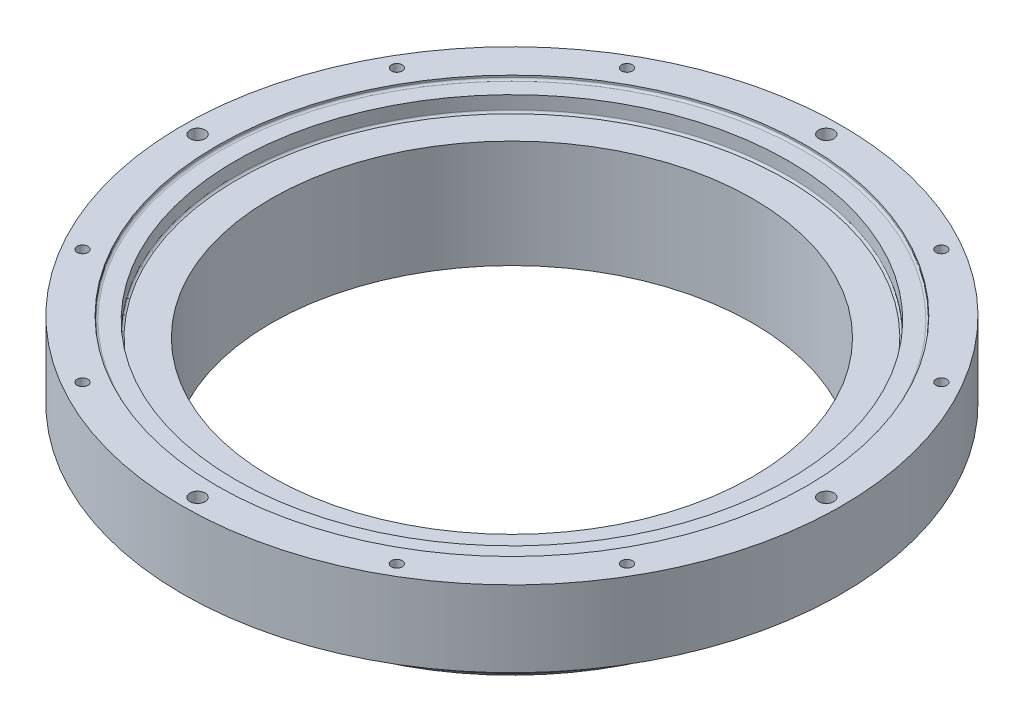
ISO-10303-21;
HEADER;
FILE_DESCRIPTION(('STEP AP214'),'2;1');
FILE_NAME('part.step','',(''),(''),'','','');
FILE_SCHEMA(('AUTOMOTIVE_DESIGN { 1 0 10303 214 1 1 1 1 }'));
ENDSEC;
DATA;
#1=APPLICATION_CONTEXT('core data for automotive mechanical design processes');
#2=APPLICATION_PROTOCOL_DEFINITION('international standard','automotive_design',2000,#1);
#3=PRODUCT_CONTEXT('',#1,'mechanical');
#4=PRODUCT('Part','Part','',(#3));
#5=PRODUCT_RELATED_PRODUCT_CATEGORY('part','',(#4));
#6=PRODUCT_DEFINITION_FORMATION('','',#4);
#7=PRODUCT_DEFINITION_CONTEXT('part definition',#1,'design');
#8=PRODUCT_DEFINITION('design','',#6,#7);
#9=PRODUCT_DEFINITION_SHAPE('','',#8);
#10=(LENGTH_UNIT() NAMED_UNIT(*) SI_UNIT(.MILLI.,.METRE.));
#11=(NAMED_UNIT(*) PLANE_ANGLE_UNIT() SI_UNIT($,.RADIAN.));
#12=(NAMED_UNIT(*) SI_UNIT($,.STERADIAN.) SOLID_ANGLE_UNIT());
#13=UNCERTAINTY_MEASURE_WITH_UNIT(LENGTH_MEASURE(1.E-05),#10,'distance_accuracy_value','');
#14=(GEOMETRIC_REPRESENTATION_CONTEXT(3) GLOBAL_UNCERTAINTY_ASSIGNED_CONTEXT((#13)) GLOBAL_UNIT_ASSIGNED_CONTEXT((#10,
#11,#12)) REPRESENTATION_CONTEXT('',''));
#15=CARTESIAN_POINT('',(0.,0.,0.));
#16=DIRECTION('',(0.,0.,1.));
#17=DIRECTION('',(1.,0.,0.));
#18=AXIS2_PLACEMENT_3D('',#15,#16,#17);
#19=CARTESIAN_POINT('',(-68.1908402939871,19.05,-39.3699999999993));
#20=DIRECTION('',(0.,1.,0.));
#21=DIRECTION('',(0.,0.,1.));
#22=AXIS2_PLACEMENT_3D('',#19,#20,#21);
#23=CYLINDRICAL_SURFACE('',#22,1.35254999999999);
#24=CARTESIAN_POINT('',(-68.1908402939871,19.05,-39.3699999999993));
#25=DIRECTION('',(0.,1.,0.));
#26=DIRECTION('',(0.,0.,1.));
#27=AXIS2_PLACEMENT_3D('',#24,#25,#26);
#28=CIRCLE('',#27,1.35254999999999);
#29=CARTESIAN_POINT('',(-68.1908402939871,19.05,-38.0174499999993));
#30=VERTEX_POINT('',#29);
#31=EDGE_CURVE('E195',#30,#30,#28,.T.);
#32=ORIENTED_EDGE('',*,*,#31,.T.);
#33=EDGE_LOOP('',(#32));
#34=FACE_BOUND('',#33,.T.);
#35=CARTESIAN_POINT('',(-68.1908402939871,12.7,-39.3699999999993));
#36=DIRECTION('',(0.,-1.,0.));
#37=DIRECTION('',(0.,0.,-1.));
#38=AXIS2_PLACEMENT_3D('',#35,#36,#37);
#39=CIRCLE('',#38,1.35254999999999);
#40=CARTESIAN_POINT('',(-68.1908402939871,12.7,-40.7225499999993));
#41=VERTEX_POINT('',#40);
#42=EDGE_CURVE('E92',#41,#41,#39,.F.);
#43=ORIENTED_EDGE('',*,*,#42,.F.);
#44=EDGE_LOOP('',(#43));
#45=FACE_BOUND('',#44,.T.);
#46=ADVANCED_FACE('F41',(#34,#45),#23,.F.);
#47=CARTESIAN_POINT('',(-39.3699999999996,19.05,68.190840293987));
#48=DIRECTION('',(0.,1.,0.));
#49=DIRECTION('',(0.,0.,1.));
#50=AXIS2_PLACEMENT_3D('',#47,#48,#49);
#51=CYLINDRICAL_SURFACE('',#50,1.35254999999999);
#52=CARTESIAN_POINT('',(-39.3699999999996,19.05,68.190840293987));
#53=DIRECTION('',(0.,1.,0.));
#54=DIRECTION('',(0.,0.,1.));
#55=AXIS2_PLACEMENT_3D('',#52,#53,#54);
#56=CIRCLE('',#55,1.35254999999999);
#57=CARTESIAN_POINT('',(-39.3699999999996,19.05,69.5433902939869));
#58=VERTEX_POINT('',#57);
#59=EDGE_CURVE('E198',#58,#58,#56,.T.);
#60=ORIENTED_EDGE('',*,*,#59,.T.);
#61=EDGE_LOOP('',(#60));
#62=FACE_BOUND('',#61,.T.);
#63=CARTESIAN_POINT('',(-39.3699999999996,12.7,68.190840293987));
#64=DIRECTION('',(0.,-1.,0.));
#65=DIRECTION('',(0.,0.,-1.));
#66=AXIS2_PLACEMENT_3D('',#63,#64,#65);
#67=CIRCLE('',#66,1.35254999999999);
#68=CARTESIAN_POINT('',(-39.3699999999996,12.7,66.838290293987));
#69=VERTEX_POINT('',#68);
#70=EDGE_CURVE('E96',#69,#69,#67,.F.);
#71=ORIENTED_EDGE('',*,*,#70,.F.);
#72=EDGE_LOOP('',(#71));
#73=FACE_BOUND('',#72,.T.);
#74=ADVANCED_FACE('F307',(#62,#73),#51,.F.);
#75=CARTESIAN_POINT('',(68.1908402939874,19.05,39.3699999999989));
#76=DIRECTION('',(0.,1.,0.));
#77=DIRECTION('',(0.,0.,1.));
#78=AXIS2_PLACEMENT_3D('',#75,#76,#77);
#79=CYLINDRICAL_SURFACE('',#78,1.35254999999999);
#80=CARTESIAN_POINT('',(68.1908402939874,19.05,39.3699999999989));
#81=DIRECTION('',(0.,1.,0.));
#82=DIRECTION('',(0.,0.,1.));
#83=AXIS2_PLACEMENT_3D('',#80,#81,#82);
#84=CIRCLE('',#83,1.35254999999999);
#85=CARTESIAN_POINT('',(68.1908402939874,19.05,40.7225499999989));
#86=VERTEX_POINT('',#85);
#87=EDGE_CURVE('E201',#86,#86,#84,.T.);
#88=ORIENTED_EDGE('',*,*,#87,.T.);
#89=EDGE_LOOP('',(#88));
#90=FACE_BOUND('',#89,.T.);
#91=CARTESIAN_POINT('',(68.1908402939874,12.7,39.3699999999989));
#92=DIRECTION('',(0.,-1.,0.));
#93=DIRECTION('',(0.,0.,-1.));
#94=AXIS2_PLACEMENT_3D('',#91,#92,#93);
#95=CIRCLE('',#94,1.35254999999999);
#96=CARTESIAN_POINT('',(68.1908402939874,12.7,38.0174499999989));
#97=VERTEX_POINT('',#96);
#98=EDGE_CURVE('E99',#97,#97,#95,.F.);
#99=ORIENTED_EDGE('',*,*,#98,.F.);
#100=EDGE_LOOP('',(#99));
#101=FACE_BOUND('',#100,.T.);
#102=ADVANCED_FACE('F313',(#90,#101),#79,.F.);
#103=CARTESIAN_POINT('',(-39.3700000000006,19.05,-68.1908402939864));
#104=DIRECTION('',(0.,1.,0.));
#105=DIRECTION('',(0.,0.,1.));
#106=AXIS2_PLACEMENT_3D('',#103,#104,#105);
#107=CYLINDRICAL_SURFACE('',#106,1.35254999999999);
#108=CARTESIAN_POINT('',(-39.3700000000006,19.05,-68.1908402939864));
#109=DIRECTION('',(0.,1.,0.));
#110=DIRECTION('',(0.,0.,1.));
#111=AXIS2_PLACEMENT_3D('',#108,#109,#110);
#112=CIRCLE('',#111,1.35254999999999);
#113=CARTESIAN_POINT('',(-39.3700000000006,19.05,-66.8382902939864));
#114=VERTEX_POINT('',#113);
#115=EDGE_CURVE('E204',#114,#114,#112,.T.);
#116=ORIENTED_EDGE('',*,*,#115,.T.);
#117=EDGE_LOOP('',(#116));
#118=FACE_BOUND('',#117,.T.);
#119=CARTESIAN_POINT('',(-39.3700000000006,12.7,-68.1908402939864));
#120=DIRECTION('',(0.,-1.,0.));
#121=DIRECTION('',(0.,0.,-1.));
#122=AXIS2_PLACEMENT_3D('',#119,#120,#121);
#123=CIRCLE('',#122,1.35254999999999);
#124=CARTESIAN_POINT('',(-39.3700000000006,12.7,-69.5433902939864));
#125=VERTEX_POINT('',#124);
#126=EDGE_CURVE('E102',#125,#125,#123,.F.);
#127=ORIENTED_EDGE('',*,*,#126,.F.);
#128=EDGE_LOOP('',(#127));
#129=FACE_BOUND('',#128,.T.);
#130=ADVANCED_FACE('F773',(#118,#129),#107,.F.);
#131=CARTESIAN_POINT('',(-68.1908402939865,19.05,39.3700000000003));
#132=DIRECTION('',(0.,1.,0.));
#133=DIRECTION('',(0.,0.,1.));
#134=AXIS2_PLACEMENT_3D('',#131,#132,#133);
#135=CYLINDRICAL_SURFACE('',#134,1.35254999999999);
#136=CARTESIAN_POINT('',(-68.1908402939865,19.05,39.3700000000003));
#137=DIRECTION('',(0.,1.,0.));
#138=DIRECTION('',(0.,0.,1.));
#139=AXIS2_PLACEMENT_3D('',#136,#137,#138);
#140=CIRCLE('',#139,1.35254999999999);
#141=CARTESIAN_POINT('',(-68.1908402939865,19.05,40.7225500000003));
#142=VERTEX_POINT('',#141);
#143=EDGE_CURVE('E207',#142,#142,#140,.T.);
#144=ORIENTED_EDGE('',*,*,#143,.T.);
#145=EDGE_LOOP('',(#144));
#146=FACE_BOUND('',#145,.T.);
#147=CARTESIAN_POINT('',(-68.1908402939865,12.7,39.3700000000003));
#148=DIRECTION('',(0.,-1.,0.));
#149=DIRECTION('',(0.,0.,-1.));
#150=AXIS2_PLACEMENT_3D('',#147,#148,#149);
#151=CIRCLE('',#150,1.35254999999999);
#152=CARTESIAN_POINT('',(-68.1908402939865,12.7,38.0174500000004));
#153=VERTEX_POINT('',#152);
#154=EDGE_CURVE('E105',#153,#153,#151,.F.);
#155=ORIENTED_EDGE('',*,*,#154,.F.);
#156=EDGE_LOOP('',(#155));
#157=FACE_BOUND('',#156,.T.);
#158=ADVANCED_FACE('F763',(#146,#157),#135,.F.);
#159=CARTESIAN_POINT('',(39.3700000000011,19.05,68.1908402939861));
#160=DIRECTION('',(0.,1.,0.));
#161=DIRECTION('',(0.,0.,1.));
#162=AXIS2_PLACEMENT_3D('',#159,#160,#161);
#163=CYLINDRICAL_SURFACE('',#162,1.35254999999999);
#164=CARTESIAN_POINT('',(39.3700000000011,19.05,68.1908402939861));
#165=DIRECTION('',(0.,1.,0.));
#166=DIRECTION('',(0.,0.,1.));
#167=AXIS2_PLACEMENT_3D('',#164,#165,#166);
#168=CIRCLE('',#167,1.35254999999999);
#169=CARTESIAN_POINT('',(39.3700000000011,19.05,69.5433902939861));
#170=VERTEX_POINT('',#169);
#171=EDGE_CURVE('E95',#170,#170,#168,.T.);
#172=ORIENTED_EDGE('',*,*,#171,.T.);
#173=EDGE_LOOP('',(#172));
#174=FACE_BOUND('',#173,.T.);
#175=CARTESIAN_POINT('',(39.3700000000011,12.7,68.1908402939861));
#176=DIRECTION('',(0.,-1.,0.));
#177=DIRECTION('',(0.,0.,-1.));
#178=AXIS2_PLACEMENT_3D('',#175,#176,#177);
#179=CIRCLE('',#178,1.35254999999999);
#180=CARTESIAN_POINT('',(39.3700000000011,12.7,66.8382902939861));
#181=VERTEX_POINT('',#180);
#182=EDGE_CURVE('E108',#181,#181,#179,.F.);
#183=ORIENTED_EDGE('',*,*,#182,.F.);
#184=EDGE_LOOP('',(#183));
#185=FACE_BOUND('',#184,.T.);
#186=ADVANCED_FACE('F356',(#174,#185),#163,.F.);
#187=CARTESIAN_POINT('',(39.3699999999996,19.05,-68.190840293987));
#188=DIRECTION('',(0.,1.,0.));
#189=DIRECTION('',(0.,0.,1.));
#190=AXIS2_PLACEMENT_3D('',#187,#188,#189);
#191=CYLINDRICAL_SURFACE('',#190,1.35254999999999);
#192=CARTESIAN_POINT('',(39.3699999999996,19.05,-68.190840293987));
#193=DIRECTION('',(0.,1.,0.));
#194=DIRECTION('',(0.,0.,1.));
#195=AXIS2_PLACEMENT_3D('',#192,#193,#194);
#196=CIRCLE('',#195,1.35254999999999);
#197=CARTESIAN_POINT('',(39.3699999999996,19.05,-66.838290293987));
#198=VERTEX_POINT('',#197);
#199=EDGE_CURVE('E174',#198,#198,#196,.T.);
#200=ORIENTED_EDGE('',*,*,#199,.T.);
#201=EDGE_LOOP('',(#200));
#202=FACE_BOUND('',#201,.T.);
#203=CARTESIAN_POINT('',(39.3699999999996,12.7,-68.190840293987));
#204=DIRECTION('',(0.,-1.,0.));
#205=DIRECTION('',(0.,0.,-1.));
#206=AXIS2_PLACEMENT_3D('',#203,#204,#205);
#207=CIRCLE('',#206,1.35254999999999);
#208=CARTESIAN_POINT('',(39.3699999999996,12.7,-69.5433902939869));
#209=VERTEX_POINT('',#208);
#210=EDGE_CURVE('E125',#209,#209,#207,.F.);
#211=ORIENTED_EDGE('',*,*,#210,.F.);
#212=EDGE_LOOP('',(#211));
#213=FACE_BOUND('',#212,.T.);
#214=ADVANCED_FACE('F352',(#202,#213),#191,.F.);
#215=CARTESIAN_POINT('',(68.1908402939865,19.05,-39.3700000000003));
#216=DIRECTION('',(0.,1.,0.));
#217=DIRECTION('',(0.,0.,1.));
#218=AXIS2_PLACEMENT_3D('',#215,#216,#217);
#219=CYLINDRICAL_SURFACE('',#218,1.35254999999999);
#220=CARTESIAN_POINT('',(68.1908402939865,19.05,-39.3700000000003));
#221=DIRECTION('',(0.,1.,0.));
#222=DIRECTION('',(0.,0.,1.));
#223=AXIS2_PLACEMENT_3D('',#220,#221,#222);
#224=CIRCLE('',#223,1.35254999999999);
#225=CARTESIAN_POINT('',(68.1908402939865,19.05,-38.0174500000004));
#226=VERTEX_POINT('',#225);
#227=EDGE_CURVE('E128',#226,#226,#224,.T.);
#228=ORIENTED_EDGE('',*,*,#227,.T.);
#229=EDGE_LOOP('',(#228));
#230=FACE_BOUND('',#229,.T.);
#231=CARTESIAN_POINT('',(68.1908402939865,12.7,-39.3700000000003));
#232=DIRECTION('',(0.,-1.,0.));
#233=DIRECTION('',(0.,0.,-1.));
#234=AXIS2_PLACEMENT_3D('',#231,#232,#233);
#235=CIRCLE('',#234,1.35254999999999);
#236=CARTESIAN_POINT('',(68.1908402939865,12.7,-40.7225500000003));
#237=VERTEX_POINT('',#236);
#238=EDGE_CURVE('E129',#237,#237,#235,.F.);
#239=ORIENTED_EDGE('',*,*,#238,.F.);
#240=EDGE_LOOP('',(#239));
#241=FACE_BOUND('',#240,.T.);
#242=ADVANCED_FACE('F348',(#230,#241),#219,.F.);
#243=CARTESIAN_POINT('',(-66.6369,-12.7,0.));
#244=DIRECTION('',(0.,-1.,0.));
#245=DIRECTION('',(0.,0.,-1.));
#246=AXIS2_PLACEMENT_3D('',#243,#244,#245);
#247=PLANE('',#246);
#248=CARTESIAN_POINT('',(0.,-12.7,0.));
#249=DIRECTION('',(0.,-1.,0.));
#250=DIRECTION('',(0.,0.,-1.));
#251=AXIS2_PLACEMENT_3D('',#248,#249,#250);
#252=CIRCLE('',#251,65.3669);
#253=CARTESIAN_POINT('',(0.,-12.7,-65.3669));
#254=VERTEX_POINT('',#253);
#255=EDGE_CURVE('E91',#254,#254,#252,.T.);
#256=ORIENTED_EDGE('',*,*,#255,.T.);
#257=EDGE_LOOP('',(#256));
#258=FACE_BOUND('',#257,.T.);
#259=CARTESIAN_POINT('',(0.,-12.7,0.));
#260=DIRECTION('',(0.,1.,0.));
#261=DIRECTION('',(0.,0.,1.));
#262=AXIS2_PLACEMENT_3D('',#259,#260,#261);
#263=CIRCLE('',#262,60.325);
#264=CARTESIAN_POINT('',(0.,-12.7,60.325));
#265=VERTEX_POINT('',#264);
#266=EDGE_CURVE('E143',#265,#265,#263,.T.);
#267=ORIENTED_EDGE('',*,*,#266,.T.);
#268=EDGE_LOOP('',(#267));
#269=FACE_BOUND('',#268,.T.);
#270=ADVANCED_FACE('F351',(#258,#269),#247,.T.);
#271=CARTESIAN_POINT('',(0.,26.1974518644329,0.));
#272=DIRECTION('',(0.,1.,0.));
#273=DIRECTION('',(0.,0.,1.));
#274=AXIS2_PLACEMENT_3D('',#271,#272,#273);
#275=CYLINDRICAL_SURFACE('',#274,60.325);
#276=CARTESIAN_POINT('',(0.,14.300581,0.));
#277=DIRECTION('',(0.,1.,0.));
#278=DIRECTION('',(0.,0.,1.));
#279=AXIS2_PLACEMENT_3D('',#276,#277,#278);
#280=CIRCLE('',#279,60.325);
#281=CARTESIAN_POINT('',(0.,14.300581,60.325));
#282=VERTEX_POINT('',#281);
#283=EDGE_CURVE('E146',#282,#282,#280,.T.);
#284=ORIENTED_EDGE('',*,*,#283,.T.);
#285=EDGE_LOOP('',(#284));
#286=FACE_BOUND('',#285,.T.);
#287=ORIENTED_EDGE('',*,*,#266,.F.);
#288=EDGE_LOOP('',(#287));
#289=FACE_BOUND('',#288,.T.);
#290=ADVANCED_FACE('F445',(#286,#289),#275,.F.);
#291=CARTESIAN_POINT('',(-60.325,14.300581,0.));
#292=DIRECTION('',(0.,1.,0.));
#293=DIRECTION('',(0.,0.,1.));
#294=AXIS2_PLACEMENT_3D('',#291,#292,#293);
#295=PLANE('',#294);
#296=CARTESIAN_POINT('',(0.,14.300581,0.));
#297=DIRECTION('',(0.,1.,0.));
#298=DIRECTION('',(0.,0.,1.));
#299=AXIS2_PLACEMENT_3D('',#296,#297,#298);
#300=CIRCLE('',#299,68.707);
#301=CARTESIAN_POINT('',(0.,14.300581,68.707));
#302=VERTEX_POINT('',#301);
#303=EDGE_CURVE('E48',#302,#302,#300,.T.);
#304=ORIENTED_EDGE('',*,*,#303,.T.);
#305=EDGE_LOOP('',(#304));
#306=FACE_BOUND('',#305,.T.);
#307=ORIENTED_EDGE('',*,*,#283,.F.);
#308=EDGE_LOOP('',(#307));
#309=FACE_BOUND('',#308,.T.);
#310=ADVANCED_FACE('F440',(#306,#309),#295,.T.);
#311=CARTESIAN_POINT('',(0.,26.1974518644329,0.));
#312=DIRECTION('',(0.,1.,0.));
#313=DIRECTION('',(0.,0.,1.));
#314=AXIS2_PLACEMENT_3D('',#311,#312,#313);
#315=CYLINDRICAL_SURFACE('',#314,69.215);
#316=CARTESIAN_POINT('',(0.,14.808581,0.));
#317=DIRECTION('',(0.,1.,0.));
#318=DIRECTION('',(0.,0.,1.));
#319=AXIS2_PLACEMENT_3D('',#316,#317,#318);
#320=CIRCLE('',#319,69.215);
#321=CARTESIAN_POINT('',(0.,14.808581,69.215));
#322=VERTEX_POINT('',#321);
#323=EDGE_CURVE('E10',#322,#322,#320,.F.);
#324=ORIENTED_EDGE('',*,*,#323,.T.);
#325=EDGE_LOOP('',(#324));
#326=FACE_BOUND('',#325,.T.);
#327=CARTESIAN_POINT('',(0.,18.0848,0.));
#328=DIRECTION('',(0.,1.,0.));
#329=DIRECTION('',(0.,0.,1.));
#330=AXIS2_PLACEMENT_3D('',#327,#328,#329);
#331=CIRCLE('',#330,69.215);
#332=CARTESIAN_POINT('',(0.,18.0848,69.215));
#333=VERTEX_POINT('',#332);
#334=EDGE_CURVE('E149',#333,#333,#331,.T.);
#335=ORIENTED_EDGE('',*,*,#334,.T.);
#336=EDGE_LOOP('',(#335));
#337=FACE_BOUND('',#336,.T.);
#338=ADVANCED_FACE('F303',(#326,#337),#315,.F.);
#339=CARTESIAN_POINT('',(-69.215,18.0848,0.));
#340=DIRECTION('',(0.,1.,0.));
#341=DIRECTION('',(0.,0.,1.));
#342=AXIS2_PLACEMENT_3D('',#339,#340,#341);
#343=PLANE('',#342);
#344=CARTESIAN_POINT('',(0.,18.0848,0.));
#345=DIRECTION('',(0.,1.,0.));
#346=DIRECTION('',(0.,0.,1.));
#347=AXIS2_PLACEMENT_3D('',#344,#345,#346);
#348=CIRCLE('',#347,73.3298);
#349=CARTESIAN_POINT('',(0.,18.0848,73.3298));
#350=VERTEX_POINT('',#349);
#351=EDGE_CURVE('E56',#350,#350,#348,.T.);
#352=ORIENTED_EDGE('',*,*,#351,.T.);
#353=EDGE_LOOP('',(#352));
#354=FACE_BOUND('',#353,.T.);
#355=ORIENTED_EDGE('',*,*,#334,.F.);
#356=EDGE_LOOP('',(#355));
#357=FACE_BOUND('',#356,.T.);
#358=ADVANCED_FACE('F297',(#354,#357),#343,.T.);
#359=CARTESIAN_POINT('',(0.,26.1974518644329,0.));
#360=DIRECTION('',(0.,1.,0.));
#361=DIRECTION('',(0.,0.,1.));
#362=AXIS2_PLACEMENT_3D('',#359,#360,#361);
#363=CYLINDRICAL_SURFACE('',#362,73.8378);
#364=CARTESIAN_POINT('',(0.,18.5928,0.));
#365=DIRECTION('',(0.,1.,0.));
#366=DIRECTION('',(0.,0.,1.));
#367=AXIS2_PLACEMENT_3D('',#364,#365,#366);
#368=CIRCLE('',#367,73.8378);
#369=CARTESIAN_POINT('',(0.,18.5928,73.8378));
#370=VERTEX_POINT('',#369);
#371=EDGE_CURVE('E52',#370,#370,#368,.F.);
#372=ORIENTED_EDGE('',*,*,#371,.T.);
#373=EDGE_LOOP('',(#372));
#374=FACE_BOUND('',#373,.T.);
#375=CARTESIAN_POINT('',(0.,19.05,0.));
#376=DIRECTION('',(0.,1.,0.));
#377=DIRECTION('',(0.,0.,1.));
#378=AXIS2_PLACEMENT_3D('',#375,#376,#377);
#379=CIRCLE('',#378,73.8378);
#380=CARTESIAN_POINT('',(0.,19.05,73.8378));
#381=VERTEX_POINT('',#380);
#382=EDGE_CURVE('E152',#381,#381,#379,.T.);
#383=ORIENTED_EDGE('',*,*,#382,.T.);
#384=EDGE_LOOP('',(#383));
#385=FACE_BOUND('',#384,.T.);
#386=ADVANCED_FACE('F291',(#374,#385),#363,.F.);
#387=CARTESIAN_POINT('',(-73.8378,19.05,0.));
#388=DIRECTION('',(0.,1.,0.));
#389=DIRECTION('',(0.,0.,1.));
#390=AXIS2_PLACEMENT_3D('',#387,#388,#389);
#391=PLANE('',#390);
#392=ORIENTED_EDGE('',*,*,#171,.F.);
#393=EDGE_LOOP('',(#392));
#394=FACE_BOUND('',#393,.T.);
#395=ORIENTED_EDGE('',*,*,#143,.F.);
#396=EDGE_LOOP('',(#395));
#397=FACE_BOUND('',#396,.T.);
#398=ORIENTED_EDGE('',*,*,#115,.F.);
#399=EDGE_LOOP('',(#398));
#400=FACE_BOUND('',#399,.T.);
#401=ORIENTED_EDGE('',*,*,#87,.F.);
#402=EDGE_LOOP('',(#401));
#403=FACE_BOUND('',#402,.T.);
#404=ORIENTED_EDGE('',*,*,#59,.F.);
#405=EDGE_LOOP('',(#404));
#406=FACE_BOUND('',#405,.T.);
#407=ORIENTED_EDGE('',*,*,#31,.F.);
#408=EDGE_LOOP('',(#407));
#409=FACE_BOUND('',#408,.T.);
#410=CARTESIAN_POINT('',(78.74,19.05,-8.24757721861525E-13));
#411=DIRECTION('',(0.,1.,0.));
#412=DIRECTION('',(0.,0.,1.));
#413=AXIS2_PLACEMENT_3D('',#410,#411,#412);
#414=CIRCLE('',#413,1.89864999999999);
#415=CARTESIAN_POINT('',(78.74,19.05,1.89864999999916));
#416=VERTEX_POINT('',#415);
#417=EDGE_CURVE('E116',#416,#416,#414,.T.);
#418=ORIENTED_EDGE('',*,*,#417,.F.);
#419=EDGE_LOOP('',(#418));
#420=FACE_BOUND('',#419,.T.);
#421=CARTESIAN_POINT('',(0.,19.05,78.74));
#422=DIRECTION('',(0.,1.,0.));
#423=DIRECTION('',(0.,0.,1.));
#424=AXIS2_PLACEMENT_3D('',#421,#422,#423);
#425=CIRCLE('',#424,1.89864999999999);
#426=CARTESIAN_POINT('',(0.,19.05,80.63865));
#427=VERTEX_POINT('',#426);
#428=EDGE_CURVE('E115',#427,#427,#425,.T.);
#429=ORIENTED_EDGE('',*,*,#428,.F.);
#430=EDGE_LOOP('',(#429));
#431=FACE_BOUND('',#430,.T.);
#432=CARTESIAN_POINT('',(-78.74,19.05,2.74919240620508E-13));
#433=DIRECTION('',(0.,1.,0.));
#434=DIRECTION('',(0.,0.,1.));
#435=AXIS2_PLACEMENT_3D('',#432,#433,#434);
#436=CIRCLE('',#435,1.89864999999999);
#437=CARTESIAN_POINT('',(-78.74,19.05,1.89865000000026));
#438=VERTEX_POINT('',#437);
#439=EDGE_CURVE('E120',#438,#438,#436,.T.);
#440=ORIENTED_EDGE('',*,*,#439,.F.);
#441=EDGE_LOOP('',(#440));
#442=FACE_BOUND('',#441,.T.);
#443=ORIENTED_EDGE('',*,*,#227,.F.);
#444=EDGE_LOOP('',(#443));
#445=FACE_BOUND('',#444,.T.);
#446=ORIENTED_EDGE('',*,*,#199,.F.);
#447=EDGE_LOOP('',(#446));
#448=FACE_BOUND('',#447,.T.);
#449=CARTESIAN_POINT('',(0.,19.05,-78.74));
#450=DIRECTION('',(0.,1.,0.));
#451=DIRECTION('',(0.,0.,1.));
#452=AXIS2_PLACEMENT_3D('',#449,#450,#451);
#453=CIRCLE('',#452,1.89864999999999);
#454=CARTESIAN_POINT('',(0.,19.05,-76.84135));
#455=VERTEX_POINT('',#454);
#456=EDGE_CURVE('E137',#455,#455,#453,.T.);
#457=ORIENTED_EDGE('',*,*,#456,.F.);
#458=EDGE_LOOP('',(#457));
#459=FACE_BOUND('',#458,.T.);
#460=CARTESIAN_POINT('',(0.,19.05,0.));
#461=DIRECTION('',(0.,1.,0.));
#462=DIRECTION('',(0.,0.,1.));
#463=AXIS2_PLACEMENT_3D('',#460,#461,#462);
#464=CIRCLE('',#463,82.55);
#465=CARTESIAN_POINT('',(0.,19.05,82.55));
#466=VERTEX_POINT('',#465);
#467=EDGE_CURVE('E155',#466,#466,#464,.T.);
#468=ORIENTED_EDGE('',*,*,#467,.T.);
#469=EDGE_LOOP('',(#468));
#470=FACE_BOUND('',#469,.T.);
#471=ORIENTED_EDGE('',*,*,#382,.F.);
#472=EDGE_LOOP('',(#471));
#473=FACE_BOUND('',#472,.T.);
#474=ADVANCED_FACE('F285',(#394,#397,#400,#403,#406,#409,#420,#431,#442,#445,#448,#459,#470,
#473),#391,.T.);
#475=CARTESIAN_POINT('',(0.,26.1974518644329,0.));
#476=DIRECTION('',(0.,1.,0.));
#477=DIRECTION('',(0.,0.,1.));
#478=AXIS2_PLACEMENT_3D('',#475,#476,#477);
#479=CYLINDRICAL_SURFACE('',#478,82.55);
#480=CARTESIAN_POINT('',(0.,0.,0.));
#481=DIRECTION('',(0.,1.,0.));
#482=DIRECTION('',(0.,0.,1.));
#483=AXIS2_PLACEMENT_3D('',#480,#481,#482);
#484=CIRCLE('',#483,82.55);
#485=CARTESIAN_POINT('',(0.,0.,82.55));
#486=VERTEX_POINT('',#485);
#487=EDGE_CURVE('E158',#486,#486,#484,.T.);
#488=ORIENTED_EDGE('',*,*,#487,.T.);
#489=EDGE_LOOP('',(#488));
#490=FACE_BOUND('',#489,.T.);
#491=ORIENTED_EDGE('',*,*,#467,.F.);
#492=EDGE_LOOP('',(#491));
#493=FACE_BOUND('',#492,.T.);
#494=ADVANCED_FACE('F262',(#490,#493),#479,.T.);
#495=CARTESIAN_POINT('',(-82.55,0.,0.));
#496=DIRECTION('',(0.,-1.,0.));
#497=DIRECTION('',(0.,0.,-1.));
#498=AXIS2_PLACEMENT_3D('',#495,#496,#497);
#499=PLANE('',#498);
#500=CARTESIAN_POINT('',(68.1908402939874,0.,39.3699999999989));
#501=DIRECTION('',(0.,-1.,0.));
#502=DIRECTION('',(1.,0.,0.));
#503=AXIS2_PLACEMENT_3D('',#500,#501,#502);
#504=CIRCLE('',#503,1.905);
#505=CARTESIAN_POINT('',(70.0958402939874,0.,39.3699999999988));
#506=VERTEX_POINT('',#505);
#507=EDGE_CURVE('E230',#506,#506,#504,.T.);
#508=ORIENTED_EDGE('',*,*,#507,.F.);
#509=EDGE_LOOP('',(#508));
#510=FACE_BOUND('',#509,.T.);
#511=CARTESIAN_POINT('',(-68.1908402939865,0.,39.3700000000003));
#512=DIRECTION('',(0.,-1.,0.));
#513=DIRECTION('',(0.,0.,1.));
#514=AXIS2_PLACEMENT_3D('',#511,#512,#513);
#515=CIRCLE('',#514,1.90500000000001);
#516=CARTESIAN_POINT('',(-68.1908402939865,0.,41.2750000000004));
#517=VERTEX_POINT('',#516);
#518=EDGE_CURVE('E237',#517,#517,#515,.T.);
#519=ORIENTED_EDGE('',*,*,#518,.F.);
#520=EDGE_LOOP('',(#519));
#521=FACE_BOUND('',#520,.T.);
#522=CARTESIAN_POINT('',(-39.3699999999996,0.,68.190840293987));
#523=DIRECTION('',(0.,-1.,0.));
#524=DIRECTION('',(0.,0.,1.));
#525=AXIS2_PLACEMENT_3D('',#522,#523,#524);
#526=CIRCLE('',#525,1.905);
#527=CARTESIAN_POINT('',(-39.3699999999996,0.,70.095840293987));
#528=VERTEX_POINT('',#527);
#529=EDGE_CURVE('E218',#528,#528,#526,.T.);
#530=ORIENTED_EDGE('',*,*,#529,.F.);
#531=EDGE_LOOP('',(#530));
#532=FACE_BOUND('',#531,.T.);
#533=CARTESIAN_POINT('',(-39.3700000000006,0.,-68.1908402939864));
#534=DIRECTION('',(0.,-1.,0.));
#535=DIRECTION('',(-1.,0.,0.));
#536=AXIS2_PLACEMENT_3D('',#533,#534,#535);
#537=CIRCLE('',#536,1.90500000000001);
#538=CARTESIAN_POINT('',(-41.2750000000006,0.,-68.1908402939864));
#539=VERTEX_POINT('',#538);
#540=EDGE_CURVE('E225',#539,#539,#537,.T.);
#541=ORIENTED_EDGE('',*,*,#540,.F.);
#542=EDGE_LOOP('',(#541));
#543=FACE_BOUND('',#542,.T.);
#544=CARTESIAN_POINT('',(39.3700000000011,0.,68.1908402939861));
#545=DIRECTION('',(0.,-1.,0.));
#546=DIRECTION('',(1.,0.,0.));
#547=AXIS2_PLACEMENT_3D('',#544,#545,#546);
#548=CIRCLE('',#547,1.90500000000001);
#549=CARTESIAN_POINT('',(41.2750000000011,0.,68.1908402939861));
#550=VERTEX_POINT('',#549);
#551=EDGE_CURVE('E242',#550,#550,#548,.T.);
#552=ORIENTED_EDGE('',*,*,#551,.F.);
#553=EDGE_LOOP('',(#552));
#554=FACE_BOUND('',#553,.T.);
#555=CARTESIAN_POINT('',(-68.1908402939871,0.,-39.3699999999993));
#556=DIRECTION('',(0.,-1.,0.));
#557=DIRECTION('',(-1.,0.,0.));
#558=AXIS2_PLACEMENT_3D('',#555,#556,#557);
#559=CIRCLE('',#558,1.905);
#560=CARTESIAN_POINT('',(-70.0958402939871,0.,-39.3699999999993));
#561=VERTEX_POINT('',#560);
#562=EDGE_CURVE('E212',#561,#561,#559,.T.);
#563=ORIENTED_EDGE('',*,*,#562,.F.);
#564=EDGE_LOOP('',(#563));
#565=FACE_BOUND('',#564,.T.);
#566=CARTESIAN_POINT('',(78.74,0.,-8.24757721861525E-13));
#567=DIRECTION('',(0.,-1.,0.));
#568=DIRECTION('',(0.,0.,-1.));
#569=AXIS2_PLACEMENT_3D('',#566,#567,#568);
#570=CIRCLE('',#569,1.89864999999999);
#571=CARTESIAN_POINT('',(78.74,0.,-1.89865000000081));
#572=VERTEX_POINT('',#571);
#573=EDGE_CURVE('E112',#572,#572,#570,.T.);
#574=ORIENTED_EDGE('',*,*,#573,.F.);
#575=EDGE_LOOP('',(#574));
#576=FACE_BOUND('',#575,.T.);
#577=CARTESIAN_POINT('',(0.,0.,78.74));
#578=DIRECTION('',(0.,-1.,0.));
#579=DIRECTION('',(0.,0.,-1.));
#580=AXIS2_PLACEMENT_3D('',#577,#578,#579);
#581=CIRCLE('',#580,1.89864999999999);
#582=CARTESIAN_POINT('',(0.,0.,76.84135));
#583=VERTEX_POINT('',#582);
#584=EDGE_CURVE('E117',#583,#583,#581,.T.);
#585=ORIENTED_EDGE('',*,*,#584,.F.);
#586=EDGE_LOOP('',(#585));
#587=FACE_BOUND('',#586,.T.);
#588=CARTESIAN_POINT('',(-78.74,0.,2.74919240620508E-13));
#589=DIRECTION('',(0.,-1.,0.));
#590=DIRECTION('',(0.,0.,-1.));
#591=AXIS2_PLACEMENT_3D('',#588,#589,#590);
#592=CIRCLE('',#591,1.89864999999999);
#593=CARTESIAN_POINT('',(-78.74,0.,-1.89864999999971));
#594=VERTEX_POINT('',#593);
#595=EDGE_CURVE('E121',#594,#594,#592,.T.);
#596=ORIENTED_EDGE('',*,*,#595,.F.);
#597=EDGE_LOOP('',(#596));
#598=FACE_BOUND('',#597,.T.);
#599=CARTESIAN_POINT('',(39.3699999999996,0.,-68.190840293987));
#600=DIRECTION('',(0.,-1.,0.));
#601=DIRECTION('',(0.,0.,-1.));
#602=AXIS2_PLACEMENT_3D('',#599,#600,#601);
#603=CIRCLE('',#602,1.905);
#604=CARTESIAN_POINT('',(39.3699999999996,0.,-70.095840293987));
#605=VERTEX_POINT('',#604);
#606=EDGE_CURVE('E184',#605,#605,#603,.T.);
#607=ORIENTED_EDGE('',*,*,#606,.F.);
#608=EDGE_LOOP('',(#607));
#609=FACE_BOUND('',#608,.T.);
#610=CARTESIAN_POINT('',(68.1908402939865,0.,-39.3700000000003));
#611=DIRECTION('',(0.,-1.,0.));
#612=DIRECTION('',(0.,0.,-1.));
#613=AXIS2_PLACEMENT_3D('',#610,#611,#612);
#614=CIRCLE('',#613,1.90500000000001);
#615=CARTESIAN_POINT('',(68.1908402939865,0.,-41.2750000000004));
#616=VERTEX_POINT('',#615);
#617=EDGE_CURVE('E124',#616,#616,#614,.T.);
#618=ORIENTED_EDGE('',*,*,#617,.F.);
#619=EDGE_LOOP('',(#618));
#620=FACE_BOUND('',#619,.T.);
#621=CARTESIAN_POINT('',(0.,0.,-78.74));
#622=DIRECTION('',(0.,-1.,0.));
#623=DIRECTION('',(0.,0.,-1.));
#624=AXIS2_PLACEMENT_3D('',#621,#622,#623);
#625=CIRCLE('',#624,1.89864999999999);
#626=CARTESIAN_POINT('',(0.,0.,-80.63865));
#627=VERTEX_POINT('',#626);
#628=EDGE_CURVE('E133',#627,#627,#625,.T.);
#629=ORIENTED_EDGE('',*,*,#628,.F.);
#630=EDGE_LOOP('',(#629));
#631=FACE_BOUND('',#630,.T.);
#632=CARTESIAN_POINT('',(0.,0.,0.));
#633=DIRECTION('',(0.,1.,0.));
#634=DIRECTION('',(0.,0.,1.));
#635=AXIS2_PLACEMENT_3D('',#632,#633,#634);
#636=CIRCLE('',#635,73.6727);
#637=CARTESIAN_POINT('',(0.,0.,73.6727));
#638=VERTEX_POINT('',#637);
#639=EDGE_CURVE('E161',#638,#638,#636,.T.);
#640=ORIENTED_EDGE('',*,*,#639,.T.);
#641=EDGE_LOOP('',(#640));
#642=FACE_BOUND('',#641,.T.);
#643=ORIENTED_EDGE('',*,*,#487,.F.);
#644=EDGE_LOOP('',(#643));
#645=FACE_BOUND('',#644,.T.);
#646=ADVANCED_FACE('F258',(#510,#521,#532,#543,#554,#565,#576,#587,#598,#609,#620,#631,#642,
#645),#499,.T.);
#647=CARTESIAN_POINT('',(0.,26.1974518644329,0.));
#648=DIRECTION('',(0.,1.,0.));
#649=DIRECTION('',(0.,0.,1.));
#650=AXIS2_PLACEMENT_3D('',#647,#648,#649);
#651=CYLINDRICAL_SURFACE('',#650,73.6727);
#652=CARTESIAN_POINT('',(0.,2.0574,0.));
#653=DIRECTION('',(0.,-1.,0.));
#654=DIRECTION('',(0.,0.,-1.));
#655=AXIS2_PLACEMENT_3D('',#652,#653,#654);
#656=CIRCLE('',#655,73.6727);
#657=CARTESIAN_POINT('',(0.,2.0574,-73.6727));
#658=VERTEX_POINT('',#657);
#659=EDGE_CURVE('E79',#658,#658,#656,.F.);
#660=ORIENTED_EDGE('',*,*,#659,.T.);
#661=EDGE_LOOP('',(#660));
#662=FACE_BOUND('',#661,.T.);
#663=ORIENTED_EDGE('',*,*,#639,.F.);
#664=EDGE_LOOP('',(#663));
#665=FACE_BOUND('',#664,.T.);
#666=ADVANCED_FACE('F261',(#662,#665),#651,.F.);
#667=CARTESIAN_POINT('',(-73.6727,2.5654,0.));
#668=DIRECTION('',(0.,-1.,0.));
#669=DIRECTION('',(0.,0.,-1.));
#670=AXIS2_PLACEMENT_3D('',#667,#668,#669);
#671=PLANE('',#670);
#672=CARTESIAN_POINT('',(0.,2.5654,0.));
#673=DIRECTION('',(0.,-1.,0.));
#674=DIRECTION('',(0.,0.,-1.));
#675=AXIS2_PLACEMENT_3D('',#672,#673,#674);
#676=CIRCLE('',#675,73.1647);
#677=CARTESIAN_POINT('',(0.,2.5654,-73.1647));
#678=VERTEX_POINT('',#677);
#679=EDGE_CURVE('E73',#678,#678,#676,.T.);
#680=ORIENTED_EDGE('',*,*,#679,.T.);
#681=EDGE_LOOP('',(#680));
#682=FACE_BOUND('',#681,.T.);
#683=CARTESIAN_POINT('',(0.,2.5654,0.));
#684=DIRECTION('',(0.,-1.,0.));
#685=DIRECTION('',(0.,0.,-1.));
#686=AXIS2_PLACEMENT_3D('',#683,#684,#685);
#687=CIRCLE('',#686,69.6849);
#688=CARTESIAN_POINT('',(0.,2.5654,-69.6849));
#689=VERTEX_POINT('',#688);
#690=EDGE_CURVE('E76',#689,#689,#687,.F.);
#691=ORIENTED_EDGE('',*,*,#690,.T.);
#692=EDGE_LOOP('',(#691));
#693=FACE_BOUND('',#692,.T.);
#694=ADVANCED_FACE('F389',(#682,#693),#671,.T.);
#695=CARTESIAN_POINT('',(0.,26.1974518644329,0.));
#696=DIRECTION('',(0.,1.,0.));
#697=DIRECTION('',(0.,0.,1.));
#698=AXIS2_PLACEMENT_3D('',#695,#696,#697);
#699=CYLINDRICAL_SURFACE('',#698,69.1769);
#700=CARTESIAN_POINT('',(0.,2.0574,0.));
#701=DIRECTION('',(0.,-1.,0.));
#702=DIRECTION('',(0.,0.,-1.));
#703=AXIS2_PLACEMENT_3D('',#700,#701,#702);
#704=CIRCLE('',#703,69.1769);
#705=CARTESIAN_POINT('',(0.,2.0574,-69.1769));
#706=VERTEX_POINT('',#705);
#707=EDGE_CURVE('E70',#706,#706,#704,.T.);
#708=ORIENTED_EDGE('',*,*,#707,.T.);
#709=EDGE_LOOP('',(#708));
#710=FACE_BOUND('',#709,.T.);
#711=CARTESIAN_POINT('',(0.,0.,0.));
#712=DIRECTION('',(0.,1.,0.));
#713=DIRECTION('',(0.,0.,1.));
#714=AXIS2_PLACEMENT_3D('',#711,#712,#713);
#715=CIRCLE('',#714,69.1769);
#716=CARTESIAN_POINT('',(0.,0.,69.1769));
#717=VERTEX_POINT('',#716);
#718=EDGE_CURVE('E164',#717,#717,#715,.T.);
#719=ORIENTED_EDGE('',*,*,#718,.T.);
#720=EDGE_LOOP('',(#719));
#721=FACE_BOUND('',#720,.T.);
#722=ADVANCED_FACE('F385',(#710,#721),#699,.T.);
#723=CARTESIAN_POINT('',(-69.1769,0.,0.));
#724=DIRECTION('',(0.,-1.,0.));
#725=DIRECTION('',(0.,0.,-1.));
#726=AXIS2_PLACEMENT_3D('',#723,#724,#725);
#727=PLANE('',#726);
#728=CARTESIAN_POINT('',(0.,0.,0.));
#729=DIRECTION('',(0.,-1.,0.));
#730=DIRECTION('',(0.,0.,-1.));
#731=AXIS2_PLACEMENT_3D('',#728,#729,#730);
#732=CIRCLE('',#731,67.1449);
#733=CARTESIAN_POINT('',(0.,0.,-67.1449));
#734=VERTEX_POINT('',#733);
#735=EDGE_CURVE('E64',#734,#734,#732,.F.);
#736=ORIENTED_EDGE('',*,*,#735,.T.);
#737=EDGE_LOOP('',(#736));
#738=FACE_BOUND('',#737,.T.);
#739=ORIENTED_EDGE('',*,*,#718,.F.);
#740=EDGE_LOOP('',(#739));
#741=FACE_BOUND('',#740,.T.);
#742=ADVANCED_FACE('F381',(#738,#741),#727,.T.);
#743=CARTESIAN_POINT('',(0.,26.1974518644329,0.));
#744=DIRECTION('',(0.,1.,0.));
#745=DIRECTION('',(0.,0.,1.));
#746=AXIS2_PLACEMENT_3D('',#743,#744,#745);
#747=CYLINDRICAL_SURFACE('',#746,66.6369);
#748=CARTESIAN_POINT('',(0.,-0.508000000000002,0.));
#749=DIRECTION('',(0.,-1.,0.));
#750=DIRECTION('',(0.,0.,-1.));
#751=AXIS2_PLACEMENT_3D('',#748,#749,#750);
#752=CIRCLE('',#751,66.6369);
#753=CARTESIAN_POINT('',(0.,-0.508000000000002,-66.6369));
#754=VERTEX_POINT('',#753);
#755=EDGE_CURVE('E61',#754,#754,#752,.T.);
#756=ORIENTED_EDGE('',*,*,#755,.T.);
#757=EDGE_LOOP('',(#756));
#758=FACE_BOUND('',#757,.T.);
#759=CARTESIAN_POINT('',(0.,-4.69795259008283,0.));
#760=DIRECTION('',(0.,1.,0.));
#761=DIRECTION('',(0.,0.,1.));
#762=AXIS2_PLACEMENT_3D('',#759,#760,#761);
#763=CIRCLE('',#762,66.6369);
#764=CARTESIAN_POINT('',(0.,-4.69795259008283,66.6369));
#765=VERTEX_POINT('',#764);
#766=EDGE_CURVE('E167',#765,#765,#763,.T.);
#767=ORIENTED_EDGE('',*,*,#766,.T.);
#768=EDGE_LOOP('',(#767));
#769=FACE_BOUND('',#768,.T.);
#770=ADVANCED_FACE('F377',(#758,#769),#747,.T.);
#771=CARTESIAN_POINT('',(-66.6369,-4.69795259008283,0.));
#772=DIRECTION('',(0.,-1.,0.));
#773=DIRECTION('',(0.,0.,-1.));
#774=AXIS2_PLACEMENT_3D('',#771,#772,#773);
#775=PLANE('',#774);
#776=CARTESIAN_POINT('',(0.,-4.69795259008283,0.));
#777=DIRECTION('',(0.,-1.,0.));
#778=DIRECTION('',(0.,0.,-1.));
#779=AXIS2_PLACEMENT_3D('',#776,#777,#778);
#780=CIRCLE('',#779,64.3763);
#781=CARTESIAN_POINT('',(0.,-4.69795259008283,-64.3763));
#782=VERTEX_POINT('',#781);
#783=EDGE_CURVE('E67',#782,#782,#780,.F.);
#784=ORIENTED_EDGE('',*,*,#783,.T.);
#785=EDGE_LOOP('',(#784));
#786=FACE_BOUND('',#785,.T.);
#787=ORIENTED_EDGE('',*,*,#766,.F.);
#788=EDGE_LOOP('',(#787));
#789=FACE_BOUND('',#788,.T.);
#790=ADVANCED_FACE('F373',(#786,#789),#775,.T.);
#791=CARTESIAN_POINT('',(0.,26.1974518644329,0.));
#792=DIRECTION('',(0.,1.,0.));
#793=DIRECTION('',(0.,0.,1.));
#794=AXIS2_PLACEMENT_3D('',#791,#792,#793);
#795=CYLINDRICAL_SURFACE('',#794,63.8683);
#796=CARTESIAN_POINT('',(0.,-8.76195259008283,0.));
#797=DIRECTION('',(0.,1.,0.));
#798=DIRECTION('',(0.,0.,1.));
#799=AXIS2_PLACEMENT_3D('',#796,#797,#798);
#800=CIRCLE('',#799,63.8683);
#801=CARTESIAN_POINT('',(0.,-8.76195259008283,63.8683));
#802=VERTEX_POINT('',#801);
#803=EDGE_CURVE('E85',#802,#802,#800,.T.);
#804=ORIENTED_EDGE('',*,*,#803,.T.);
#805=EDGE_LOOP('',(#804));
#806=FACE_BOUND('',#805,.T.);
#807=CARTESIAN_POINT('',(0.,-5.20595259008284,0.));
#808=DIRECTION('',(0.,-1.,0.));
#809=DIRECTION('',(0.,0.,-1.));
#810=AXIS2_PLACEMENT_3D('',#807,#808,#809);
#811=CIRCLE('',#810,63.8683);
#812=CARTESIAN_POINT('',(0.,-5.20595259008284,-63.8683));
#813=VERTEX_POINT('',#812);
#814=EDGE_CURVE('E88',#813,#813,#811,.T.);
#815=ORIENTED_EDGE('',*,*,#814,.T.);
#816=EDGE_LOOP('',(#815));
#817=FACE_BOUND('',#816,.T.);
#818=ADVANCED_FACE('F369',(#806,#817),#795,.T.);
#819=CARTESIAN_POINT('',(-63.8683,-9.26995259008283,0.));
#820=DIRECTION('',(0.,1.,0.));
#821=DIRECTION('',(0.,0.,1.));
#822=AXIS2_PLACEMENT_3D('',#819,#820,#821);
#823=PLANE('',#822);
#824=CARTESIAN_POINT('',(0.,-9.26995259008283,0.));
#825=DIRECTION('',(0.,1.,0.));
#826=DIRECTION('',(0.,0.,1.));
#827=AXIS2_PLACEMENT_3D('',#824,#825,#826);
#828=CIRCLE('',#827,64.3763);
#829=CARTESIAN_POINT('',(0.,-9.26995259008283,64.3763));
#830=VERTEX_POINT('',#829);
#831=EDGE_CURVE('E82',#830,#830,#828,.F.);
#832=ORIENTED_EDGE('',*,*,#831,.T.);
#833=EDGE_LOOP('',(#832));
#834=FACE_BOUND('',#833,.T.);
#835=CARTESIAN_POINT('',(0.,-9.26995259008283,0.));
#836=DIRECTION('',(0.,1.,0.));
#837=DIRECTION('',(0.,0.,1.));
#838=AXIS2_PLACEMENT_3D('',#835,#836,#837);
#839=CIRCLE('',#838,66.6369);
#840=CARTESIAN_POINT('',(0.,-9.26995259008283,66.6369));
#841=VERTEX_POINT('',#840);
#842=EDGE_CURVE('E136',#841,#841,#839,.T.);
#843=ORIENTED_EDGE('',*,*,#842,.T.);
#844=EDGE_LOOP('',(#843));
#845=FACE_BOUND('',#844,.T.);
#846=ADVANCED_FACE('F365',(#834,#845),#823,.T.);
#847=CARTESIAN_POINT('',(0.,26.1974518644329,0.));
#848=DIRECTION('',(0.,1.,0.));
#849=DIRECTION('',(0.,0.,1.));
#850=AXIS2_PLACEMENT_3D('',#847,#848,#849);
#851=CYLINDRICAL_SURFACE('',#850,66.6369);
#852=CARTESIAN_POINT('',(0.,-11.43,0.));
#853=DIRECTION('',(0.,-1.,0.));
#854=DIRECTION('',(0.,0.,-1.));
#855=AXIS2_PLACEMENT_3D('',#852,#853,#854);
#856=CIRCLE('',#855,66.6369);
#857=CARTESIAN_POINT('',(0.,-11.43,-66.6369));
#858=VERTEX_POINT('',#857);
#859=EDGE_CURVE('E140',#858,#858,#856,.F.);
#860=ORIENTED_EDGE('',*,*,#859,.T.);
#861=EDGE_LOOP('',(#860));
#862=FACE_BOUND('',#861,.T.);
#863=ORIENTED_EDGE('',*,*,#842,.F.);
#864=EDGE_LOOP('',(#863));
#865=FACE_BOUND('',#864,.T.);
#866=ADVANCED_FACE('F362',(#862,#865),#851,.T.);
#867=CARTESIAN_POINT('',(0.,-11.43,0.));
#868=DIRECTION('',(0.,1.,0.));
#869=DIRECTION('',(0.,0.,1.));
#870=AXIS2_PLACEMENT_3D('',#867,#868,#869);
#871=CONICAL_SURFACE('',#870,66.6369,0.785398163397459);
#872=ORIENTED_EDGE('',*,*,#255,.F.);
#873=EDGE_LOOP('',(#872));
#874=FACE_BOUND('',#873,.T.);
#875=ORIENTED_EDGE('',*,*,#859,.F.);
#876=EDGE_LOOP('',(#875));
#877=FACE_BOUND('',#876,.T.);
#878=ADVANCED_FACE('F360',(#874,#877),#871,.T.);
#879=CARTESIAN_POINT('',(0.,19.05,-78.74));
#880=DIRECTION('',(0.,1.,0.));
#881=DIRECTION('',(0.,0.,1.));
#882=AXIS2_PLACEMENT_3D('',#879,#880,#881);
#883=CYLINDRICAL_SURFACE('',#882,1.89864999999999);
#884=ORIENTED_EDGE('',*,*,#628,.T.);
#885=EDGE_LOOP('',(#884));
#886=FACE_BOUND('',#885,.T.);
#887=ORIENTED_EDGE('',*,*,#456,.T.);
#888=EDGE_LOOP('',(#887));
#889=FACE_BOUND('',#888,.T.);
#890=ADVANCED_FACE('F343',(#886,#889),#883,.F.);
#891=CARTESIAN_POINT('',(68.1908402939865,12.7,-39.3700000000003));
#892=DIRECTION('',(0.,-1.,0.));
#893=DIRECTION('',(0.,0.,-1.));
#894=AXIS2_PLACEMENT_3D('',#891,#892,#893);
#895=PLANE('',#894);
#896=CARTESIAN_POINT('',(68.1908402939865,12.7,-39.3700000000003));
#897=DIRECTION('',(0.,-1.,0.));
#898=DIRECTION('',(0.,0.,-1.));
#899=AXIS2_PLACEMENT_3D('',#896,#897,#898);
#900=CIRCLE('',#899,1.90500000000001);
#901=CARTESIAN_POINT('',(68.1908402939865,12.7,-41.2750000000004));
#902=VERTEX_POINT('',#901);
#903=EDGE_CURVE('E181',#902,#902,#900,.T.);
#904=ORIENTED_EDGE('',*,*,#903,.T.);
#905=EDGE_LOOP('',(#904));
#906=FACE_BOUND('',#905,.T.);
#907=ORIENTED_EDGE('',*,*,#238,.T.);
#908=EDGE_LOOP('',(#907));
#909=FACE_BOUND('',#908,.T.);
#910=ADVANCED_FACE('F340',(#906,#909),#895,.T.);
#911=CARTESIAN_POINT('',(68.1908402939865,12.7,-39.3700000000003));
#912=DIRECTION('',(0.,-1.,0.));
#913=DIRECTION('',(0.,0.,-1.));
#914=AXIS2_PLACEMENT_3D('',#911,#912,#913);
#915=CYLINDRICAL_SURFACE('',#914,1.90500000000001);
#916=ORIENTED_EDGE('',*,*,#903,.F.);
#917=EDGE_LOOP('',(#916));
#918=FACE_BOUND('',#917,.T.);
#919=ORIENTED_EDGE('',*,*,#617,.T.);
#920=EDGE_LOOP('',(#919));
#921=FACE_BOUND('',#920,.T.);
#922=ADVANCED_FACE('F335',(#918,#921),#915,.F.);
#923=CARTESIAN_POINT('',(39.3699999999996,12.7,-68.190840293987));
#924=DIRECTION('',(0.,-1.,0.));
#925=DIRECTION('',(0.,0.,-1.));
#926=AXIS2_PLACEMENT_3D('',#923,#924,#925);
#927=PLANE('',#926);
#928=CARTESIAN_POINT('',(39.3699999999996,12.7,-68.190840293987));
#929=DIRECTION('',(0.,-1.,0.));
#930=DIRECTION('',(0.,0.,-1.));
#931=AXIS2_PLACEMENT_3D('',#928,#929,#930);
#932=CIRCLE('',#931,1.905);
#933=CARTESIAN_POINT('',(39.3699999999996,12.7,-70.095840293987));
#934=VERTEX_POINT('',#933);
#935=EDGE_CURVE('E132',#934,#934,#932,.T.);
#936=ORIENTED_EDGE('',*,*,#935,.T.);
#937=EDGE_LOOP('',(#936));
#938=FACE_BOUND('',#937,.T.);
#939=ORIENTED_EDGE('',*,*,#210,.T.);
#940=EDGE_LOOP('',(#939));
#941=FACE_BOUND('',#940,.T.);
#942=ADVANCED_FACE('F332',(#938,#941),#927,.T.);
#943=CARTESIAN_POINT('',(39.3699999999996,12.7,-68.190840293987));
#944=DIRECTION('',(0.,-1.,0.));
#945=DIRECTION('',(0.,0.,-1.));
#946=AXIS2_PLACEMENT_3D('',#943,#944,#945);
#947=CYLINDRICAL_SURFACE('',#946,1.905);
#948=ORIENTED_EDGE('',*,*,#935,.F.);
#949=EDGE_LOOP('',(#948));
#950=FACE_BOUND('',#949,.T.);
#951=ORIENTED_EDGE('',*,*,#606,.T.);
#952=EDGE_LOOP('',(#951));
#953=FACE_BOUND('',#952,.T.);
#954=ADVANCED_FACE('F330',(#950,#953),#947,.F.);
#955=CARTESIAN_POINT('',(-78.74,19.05,2.74919240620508E-13));
#956=DIRECTION('',(0.,1.,0.));
#957=DIRECTION('',(0.,0.,1.));
#958=AXIS2_PLACEMENT_3D('',#955,#956,#957);
#959=CYLINDRICAL_SURFACE('',#958,1.89864999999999);
#960=ORIENTED_EDGE('',*,*,#595,.T.);
#961=EDGE_LOOP('',(#960));
#962=FACE_BOUND('',#961,.T.);
#963=ORIENTED_EDGE('',*,*,#439,.T.);
#964=EDGE_LOOP('',(#963));
#965=FACE_BOUND('',#964,.T.);
#966=ADVANCED_FACE('F326',(#962,#965),#959,.F.);
#967=CARTESIAN_POINT('',(0.,19.05,78.74));
#968=DIRECTION('',(0.,1.,0.));
#969=DIRECTION('',(0.,0.,1.));
#970=AXIS2_PLACEMENT_3D('',#967,#968,#969);
#971=CYLINDRICAL_SURFACE('',#970,1.89864999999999);
#972=ORIENTED_EDGE('',*,*,#584,.T.);
#973=EDGE_LOOP('',(#972));
#974=FACE_BOUND('',#973,.T.);
#975=ORIENTED_EDGE('',*,*,#428,.T.);
#976=EDGE_LOOP('',(#975));
#977=FACE_BOUND('',#976,.T.);
#978=ADVANCED_FACE('F322',(#974,#977),#971,.F.);
#979=CARTESIAN_POINT('',(78.74,19.05,-8.24757721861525E-13));
#980=DIRECTION('',(0.,1.,0.));
#981=DIRECTION('',(0.,0.,1.));
#982=AXIS2_PLACEMENT_3D('',#979,#980,#981);
#983=CYLINDRICAL_SURFACE('',#982,1.89864999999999);
#984=ORIENTED_EDGE('',*,*,#573,.T.);
#985=EDGE_LOOP('',(#984));
#986=FACE_BOUND('',#985,.T.);
#987=ORIENTED_EDGE('',*,*,#417,.T.);
#988=EDGE_LOOP('',(#987));
#989=FACE_BOUND('',#988,.T.);
#990=ADVANCED_FACE('F319',(#986,#989),#983,.F.);
#991=CARTESIAN_POINT('',(39.3700000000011,12.7,68.1908402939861));
#992=DIRECTION('',(0.,-1.,0.));
#993=DIRECTION('',(1.,0.,0.));
#994=AXIS2_PLACEMENT_3D('',#991,#992,#993);
#995=PLANE('',#994);
#996=CARTESIAN_POINT('',(39.3700000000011,12.7,68.1908402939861));
#997=DIRECTION('',(0.,-1.,0.));
#998=DIRECTION('',(1.,0.,0.));
#999=AXIS2_PLACEMENT_3D('',#996,#997,#998);
#1000=CIRCLE('',#999,1.90500000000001);
#1001=CARTESIAN_POINT('',(41.2750000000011,12.7,68.1908402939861));
#1002=VERTEX_POINT('',#1001);
#1003=EDGE_CURVE('E234',#1002,#1002,#1000,.T.);
#1004=ORIENTED_EDGE('',*,*,#1003,.T.);
#1005=EDGE_LOOP('',(#1004));
#1006=FACE_BOUND('',#1005,.T.);
#1007=ORIENTED_EDGE('',*,*,#182,.T.);
#1008=EDGE_LOOP('',(#1007));
#1009=FACE_BOUND('',#1008,.T.);
#1010=ADVANCED_FACE('F248',(#1006,#1009),#995,.T.);
#1011=CARTESIAN_POINT('',(39.3700000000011,12.7,68.1908402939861));
#1012=DIRECTION('',(0.,-1.,0.));
#1013=DIRECTION('',(0.,0.,-1.));
#1014=AXIS2_PLACEMENT_3D('',#1011,#1012,#1013);
#1015=CYLINDRICAL_SURFACE('',#1014,1.90500000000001);
#1016=ORIENTED_EDGE('',*,*,#1003,.F.);
#1017=EDGE_LOOP('',(#1016));
#1018=FACE_BOUND('',#1017,.T.);
#1019=ORIENTED_EDGE('',*,*,#551,.T.);
#1020=EDGE_LOOP('',(#1019));
#1021=FACE_BOUND('',#1020,.T.);
#1022=ADVANCED_FACE('F251',(#1018,#1021),#1015,.F.);
#1023=CARTESIAN_POINT('',(-68.1908402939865,12.7,39.3700000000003));
#1024=DIRECTION('',(0.,-1.,0.));
#1025=DIRECTION('',(0.,0.,1.));
#1026=AXIS2_PLACEMENT_3D('',#1023,#1024,#1025);
#1027=PLANE('',#1026);
#1028=CARTESIAN_POINT('',(-68.1908402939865,12.7,39.3700000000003));
#1029=DIRECTION('',(0.,-1.,0.));
#1030=DIRECTION('',(0.,0.,1.));
#1031=AXIS2_PLACEMENT_3D('',#1028,#1029,#1030);
#1032=CIRCLE('',#1031,1.90500000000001);
#1033=CARTESIAN_POINT('',(-68.1908402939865,12.7,41.2750000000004));
#1034=VERTEX_POINT('',#1033);
#1035=EDGE_CURVE('E222',#1034,#1034,#1032,.T.);
#1036=ORIENTED_EDGE('',*,*,#1035,.T.);
#1037=EDGE_LOOP('',(#1036));
#1038=FACE_BOUND('',#1037,.T.);
#1039=ORIENTED_EDGE('',*,*,#154,.T.);
#1040=EDGE_LOOP('',(#1039));
#1041=FACE_BOUND('',#1040,.T.);
#1042=ADVANCED_FACE('F254',(#1038,#1041),#1027,.T.);
#1043=CARTESIAN_POINT('',(-68.1908402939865,12.7,39.3700000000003));
#1044=DIRECTION('',(0.,-1.,0.));
#1045=DIRECTION('',(0.,0.,-1.));
#1046=AXIS2_PLACEMENT_3D('',#1043,#1044,#1045);
#1047=CYLINDRICAL_SURFACE('',#1046,1.90500000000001);
#1048=ORIENTED_EDGE('',*,*,#1035,.F.);
#1049=EDGE_LOOP('',(#1048));
#1050=FACE_BOUND('',#1049,.T.);
#1051=ORIENTED_EDGE('',*,*,#518,.T.);
#1052=EDGE_LOOP('',(#1051));
#1053=FACE_BOUND('',#1052,.T.);
#1054=ADVANCED_FACE('F524',(#1050,#1053),#1047,.F.);
#1055=CARTESIAN_POINT('',(-39.3700000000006,12.7,-68.1908402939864));
#1056=DIRECTION('',(0.,-1.,0.));
#1057=DIRECTION('',(-1.,0.,0.));
#1058=AXIS2_PLACEMENT_3D('',#1055,#1056,#1057);
#1059=PLANE('',#1058);
#1060=CARTESIAN_POINT('',(-39.3700000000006,12.7,-68.1908402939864));
#1061=DIRECTION('',(0.,-1.,0.));
#1062=DIRECTION('',(-1.,0.,0.));
#1063=AXIS2_PLACEMENT_3D('',#1060,#1061,#1062);
#1064=CIRCLE('',#1063,1.90500000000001);
#1065=CARTESIAN_POINT('',(-41.2750000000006,12.7,-68.1908402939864));
#1066=VERTEX_POINT('',#1065);
#1067=EDGE_CURVE('E215',#1066,#1066,#1064,.T.);
#1068=ORIENTED_EDGE('',*,*,#1067,.T.);
#1069=EDGE_LOOP('',(#1068));
#1070=FACE_BOUND('',#1069,.T.);
#1071=ORIENTED_EDGE('',*,*,#126,.T.);
#1072=EDGE_LOOP('',(#1071));
#1073=FACE_BOUND('',#1072,.T.);
#1074=ADVANCED_FACE('F532',(#1070,#1073),#1059,.T.);
#1075=CARTESIAN_POINT('',(-39.3700000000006,12.7,-68.1908402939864));
#1076=DIRECTION('',(0.,-1.,0.));
#1077=DIRECTION('',(0.,0.,-1.));
#1078=AXIS2_PLACEMENT_3D('',#1075,#1076,#1077);
#1079=CYLINDRICAL_SURFACE('',#1078,1.90500000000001);
#1080=ORIENTED_EDGE('',*,*,#1067,.F.);
#1081=EDGE_LOOP('',(#1080));
#1082=FACE_BOUND('',#1081,.T.);
#1083=ORIENTED_EDGE('',*,*,#540,.T.);
#1084=EDGE_LOOP('',(#1083));
#1085=FACE_BOUND('',#1084,.T.);
#1086=ADVANCED_FACE('F540',(#1082,#1085),#1079,.F.);
#1087=CARTESIAN_POINT('',(68.1908402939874,12.7,39.3699999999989));
#1088=DIRECTION('',(0.,-1.,0.));
#1089=DIRECTION('',(1.,0.,0.));
#1090=AXIS2_PLACEMENT_3D('',#1087,#1088,#1089);
#1091=PLANE('',#1090);
#1092=CARTESIAN_POINT('',(68.1908402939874,12.7,39.3699999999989));
#1093=DIRECTION('',(0.,-1.,0.));
#1094=DIRECTION('',(1.,0.,0.));
#1095=AXIS2_PLACEMENT_3D('',#1092,#1093,#1094);
#1096=CIRCLE('',#1095,1.905);
#1097=CARTESIAN_POINT('',(70.0958402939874,12.7,39.3699999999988));
#1098=VERTEX_POINT('',#1097);
#1099=EDGE_CURVE('E233',#1098,#1098,#1096,.T.);
#1100=ORIENTED_EDGE('',*,*,#1099,.T.);
#1101=EDGE_LOOP('',(#1100));
#1102=FACE_BOUND('',#1101,.T.);
#1103=ORIENTED_EDGE('',*,*,#98,.T.);
#1104=EDGE_LOOP('',(#1103));
#1105=FACE_BOUND('',#1104,.T.);
#1106=ADVANCED_FACE('F548',(#1102,#1105),#1091,.T.);
#1107=CARTESIAN_POINT('',(68.1908402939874,12.7,39.3699999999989));
#1108=DIRECTION('',(0.,-1.,0.));
#1109=DIRECTION('',(0.,0.,-1.));
#1110=AXIS2_PLACEMENT_3D('',#1107,#1108,#1109);
#1111=CYLINDRICAL_SURFACE('',#1110,1.905);
#1112=ORIENTED_EDGE('',*,*,#1099,.F.);
#1113=EDGE_LOOP('',(#1112));
#1114=FACE_BOUND('',#1113,.T.);
#1115=ORIENTED_EDGE('',*,*,#507,.T.);
#1116=EDGE_LOOP('',(#1115));
#1117=FACE_BOUND('',#1116,.T.);
#1118=ADVANCED_FACE('F556',(#1114,#1117),#1111,.F.);
#1119=CARTESIAN_POINT('',(-39.3699999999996,12.7,68.190840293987));
#1120=DIRECTION('',(0.,-1.,0.));
#1121=DIRECTION('',(0.,0.,1.));
#1122=AXIS2_PLACEMENT_3D('',#1119,#1120,#1121);
#1123=PLANE('',#1122);
#1124=CARTESIAN_POINT('',(-39.3699999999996,12.7,68.190840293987));
#1125=DIRECTION('',(0.,-1.,0.));
#1126=DIRECTION('',(0.,0.,1.));
#1127=AXIS2_PLACEMENT_3D('',#1124,#1125,#1126);
#1128=CIRCLE('',#1127,1.905);
#1129=CARTESIAN_POINT('',(-39.3699999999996,12.7,70.095840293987));
#1130=VERTEX_POINT('',#1129);
#1131=EDGE_CURVE('E221',#1130,#1130,#1128,.T.);
#1132=ORIENTED_EDGE('',*,*,#1131,.T.);
#1133=EDGE_LOOP('',(#1132));
#1134=FACE_BOUND('',#1133,.T.);
#1135=ORIENTED_EDGE('',*,*,#70,.T.);
#1136=EDGE_LOOP('',(#1135));
#1137=FACE_BOUND('',#1136,.T.);
#1138=ADVANCED_FACE('F564',(#1134,#1137),#1123,.T.);
#1139=CARTESIAN_POINT('',(-39.3699999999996,12.7,68.190840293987));
#1140=DIRECTION('',(0.,-1.,0.));
#1141=DIRECTION('',(0.,0.,-1.));
#1142=AXIS2_PLACEMENT_3D('',#1139,#1140,#1141);
#1143=CYLINDRICAL_SURFACE('',#1142,1.905);
#1144=ORIENTED_EDGE('',*,*,#1131,.F.);
#1145=EDGE_LOOP('',(#1144));
#1146=FACE_BOUND('',#1145,.T.);
#1147=ORIENTED_EDGE('',*,*,#529,.T.);
#1148=EDGE_LOOP('',(#1147));
#1149=FACE_BOUND('',#1148,.T.);
#1150=ADVANCED_FACE('F572',(#1146,#1149),#1143,.F.);
#1151=CARTESIAN_POINT('',(-68.1908402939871,12.7,-39.3699999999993));
#1152=DIRECTION('',(0.,-1.,0.));
#1153=DIRECTION('',(-1.,0.,0.));
#1154=AXIS2_PLACEMENT_3D('',#1151,#1152,#1153);
#1155=PLANE('',#1154);
#1156=CARTESIAN_POINT('',(-68.1908402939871,12.7,-39.3699999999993));
#1157=DIRECTION('',(0.,-1.,0.));
#1158=DIRECTION('',(-1.,0.,0.));
#1159=AXIS2_PLACEMENT_3D('',#1156,#1157,#1158);
#1160=CIRCLE('',#1159,1.905);
#1161=CARTESIAN_POINT('',(-70.0958402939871,12.7,-39.3699999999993));
#1162=VERTEX_POINT('',#1161);
#1163=EDGE_CURVE('E111',#1162,#1162,#1160,.T.);
#1164=ORIENTED_EDGE('',*,*,#1163,.T.);
#1165=EDGE_LOOP('',(#1164));
#1166=FACE_BOUND('',#1165,.T.);
#1167=ORIENTED_EDGE('',*,*,#42,.T.);
#1168=EDGE_LOOP('',(#1167));
#1169=FACE_BOUND('',#1168,.T.);
#1170=ADVANCED_FACE('F580',(#1166,#1169),#1155,.T.);
#1171=CARTESIAN_POINT('',(-68.1908402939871,12.7,-39.3699999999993));
#1172=DIRECTION('',(0.,-1.,0.));
#1173=DIRECTION('',(0.,0.,-1.));
#1174=AXIS2_PLACEMENT_3D('',#1171,#1172,#1173);
#1175=CYLINDRICAL_SURFACE('',#1174,1.905);
#1176=ORIENTED_EDGE('',*,*,#1163,.F.);
#1177=EDGE_LOOP('',(#1176));
#1178=FACE_BOUND('',#1177,.T.);
#1179=ORIENTED_EDGE('',*,*,#562,.T.);
#1180=EDGE_LOOP('',(#1179));
#1181=FACE_BOUND('',#1180,.T.);
#1182=ADVANCED_FACE('F414',(#1178,#1181),#1175,.F.);
#1183=CARTESIAN_POINT('',(0.,-8.76195259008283,0.));
#1184=DIRECTION('',(0.,1.,0.));
#1185=DIRECTION('',(0.,0.,1.));
#1186=AXIS2_PLACEMENT_3D('',#1183,#1184,#1185);
#1187=TOROIDAL_SURFACE('',#1186,64.3763,0.508);
#1188=ORIENTED_EDGE('',*,*,#831,.F.);
#1189=EDGE_LOOP('',(#1188));
#1190=FACE_BOUND('',#1189,.T.);
#1191=ORIENTED_EDGE('',*,*,#803,.F.);
#1192=EDGE_LOOP('',(#1191));
#1193=FACE_BOUND('',#1192,.T.);
#1194=ADVANCED_FACE('F404',(#1190,#1193),#1187,.F.);
#1195=CARTESIAN_POINT('',(0.,2.0574,0.));
#1196=DIRECTION('',(0.,-1.,0.));
#1197=DIRECTION('',(0.,0.,-1.));
#1198=AXIS2_PLACEMENT_3D('',#1195,#1196,#1197);
#1199=TOROIDAL_SURFACE('',#1198,73.1647,0.508);
#1200=ORIENTED_EDGE('',*,*,#679,.F.);
#1201=EDGE_LOOP('',(#1200));
#1202=FACE_BOUND('',#1201,.T.);
#1203=ORIENTED_EDGE('',*,*,#659,.F.);
#1204=EDGE_LOOP('',(#1203));
#1205=FACE_BOUND('',#1204,.T.);
#1206=ADVANCED_FACE('F401',(#1202,#1205),#1199,.F.);
#1207=CARTESIAN_POINT('',(0.,2.0574,0.));
#1208=DIRECTION('',(0.,-1.,0.));
#1209=DIRECTION('',(0.,0.,-1.));
#1210=AXIS2_PLACEMENT_3D('',#1207,#1208,#1209);
#1211=TOROIDAL_SURFACE('',#1210,69.6849,0.508);
#1212=ORIENTED_EDGE('',*,*,#707,.F.);
#1213=EDGE_LOOP('',(#1212));
#1214=FACE_BOUND('',#1213,.T.);
#1215=ORIENTED_EDGE('',*,*,#690,.F.);
#1216=EDGE_LOOP('',(#1215));
#1217=FACE_BOUND('',#1216,.T.);
#1218=ADVANCED_FACE('F403',(#1214,#1217),#1211,.F.);
#1219=CARTESIAN_POINT('',(0.,-5.20595259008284,0.));
#1220=DIRECTION('',(0.,-1.,0.));
#1221=DIRECTION('',(0.,0.,-1.));
#1222=AXIS2_PLACEMENT_3D('',#1219,#1220,#1221);
#1223=TOROIDAL_SURFACE('',#1222,64.3763,0.508);
#1224=ORIENTED_EDGE('',*,*,#814,.F.);
#1225=EDGE_LOOP('',(#1224));
#1226=FACE_BOUND('',#1225,.T.);
#1227=ORIENTED_EDGE('',*,*,#783,.F.);
#1228=EDGE_LOOP('',(#1227));
#1229=FACE_BOUND('',#1228,.T.);
#1230=ADVANCED_FACE('F411',(#1226,#1229),#1223,.F.);
#1231=CARTESIAN_POINT('',(0.,-0.508000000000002,0.));
#1232=DIRECTION('',(0.,-1.,0.));
#1233=DIRECTION('',(0.,0.,-1.));
#1234=AXIS2_PLACEMENT_3D('',#1231,#1232,#1233);
#1235=TOROIDAL_SURFACE('',#1234,67.1449,0.508);
#1236=ORIENTED_EDGE('',*,*,#755,.F.);
#1237=EDGE_LOOP('',(#1236));
#1238=FACE_BOUND('',#1237,.T.);
#1239=ORIENTED_EDGE('',*,*,#735,.F.);
#1240=EDGE_LOOP('',(#1239));
#1241=FACE_BOUND('',#1240,.T.);
#1242=ADVANCED_FACE('F422',(#1238,#1241),#1235,.F.);
#1243=CARTESIAN_POINT('',(0.,18.5928,0.));
#1244=DIRECTION('',(0.,1.,0.));
#1245=DIRECTION('',(0.,0.,1.));
#1246=AXIS2_PLACEMENT_3D('',#1243,#1244,#1245);
#1247=TOROIDAL_SURFACE('',#1246,73.3298,0.508);
#1248=ORIENTED_EDGE('',*,*,#371,.F.);
#1249=EDGE_LOOP('',(#1248));
#1250=FACE_BOUND('',#1249,.T.);
#1251=ORIENTED_EDGE('',*,*,#351,.F.);
#1252=EDGE_LOOP('',(#1251));
#1253=FACE_BOUND('',#1252,.T.);
#1254=ADVANCED_FACE('F425',(#1250,#1253),#1247,.F.);
#1255=CARTESIAN_POINT('',(0.,14.808581,0.));
#1256=DIRECTION('',(0.,1.,0.));
#1257=DIRECTION('',(0.,0.,1.));
#1258=AXIS2_PLACEMENT_3D('',#1255,#1256,#1257);
#1259=TOROIDAL_SURFACE('',#1258,68.707,0.508);
#1260=ORIENTED_EDGE('',*,*,#323,.F.);
#1261=EDGE_LOOP('',(#1260));
#1262=FACE_BOUND('',#1261,.T.);
#1263=ORIENTED_EDGE('',*,*,#303,.F.);
#1264=EDGE_LOOP('',(#1263));
#1265=FACE_BOUND('',#1264,.T.);
#1266=ADVANCED_FACE('F43',(#1262,#1265),#1259,.F.);
#1267=CLOSED_SHELL('',(#46,#74,#102,#130,#158,#186,#214,#242,#270,#290,#310,#338,#358,#386,#474,
#494,#646,#666,#694,#722,#742,#770,#790,#818,#846,#866,#878,#890,#910,#922,#942,#954,#966,#978,
#990,#1010,#1022,#1042,#1054,#1074,#1086,#1106,#1118,#1138,#1150,#1170,#1182,#1194,#1206,#1218,
#1230,#1242,#1254,#1266));
#1268=MANIFOLD_SOLID_BREP('B2',#1267);
#1269=ADVANCED_BREP_SHAPE_REPRESENTATION('',(#18,#1268),#14);
#1270=SHAPE_DEFINITION_REPRESENTATION(#9,#1269);
ENDSEC;
END-ISO-10303-21;
